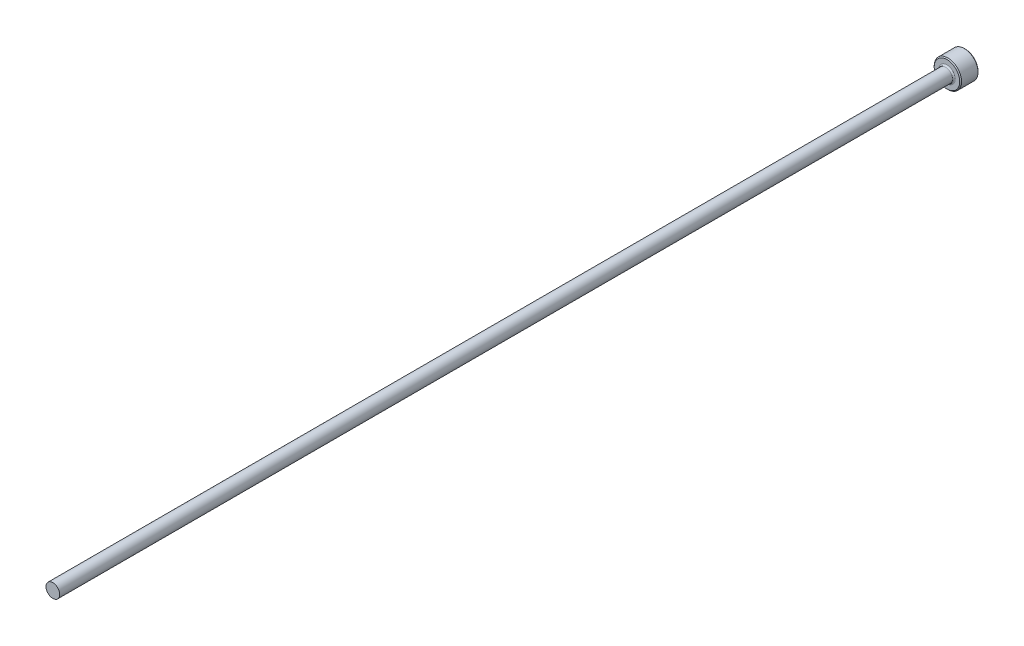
from build123d import *

# Parameters (mm, degrees)
CHAMFER1_SIZE = 0.2


with BuildPart() as part:
    # Sketch1 → Revolve1 (revolve)
    with BuildSketch(Plane(origin=(0, 0, 0), x_dir=(0, 0, -1), z_dir=(1, 0, 0)), mode=Mode.PRIVATE) as revolve1_sk:
        with BuildLine():
            Line((0, 0), (0, 3))
            Line((0, 3), (-4, 3))
            Line((-4, 3), (-4, 1.8))
            ThreePointArc((-4, 1.8), (-4.087867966, 1.587867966), (-4.3, 1.5))
            Line((-4.3, 1.5), (-200, 1.5))
            Line((-200, 1.5), (-200, 0))
            Line((-200, 0), (0, 0))
        make_face()
    revolve(revolve1_sk.sketch.rotate(Axis((0, 0, 109.05062828), (0, 0, -1)), 90), axis=Axis((0, 0, 109.05062828), (0, 0, -1)))

    # Chamfer1
    chamfer1_edges = [part.edges().sort_by_distance(p)[0] for p in [
        (-3, 0, 0),
        (-3, 0, 4),
    ]]
    chamfer(chamfer1_edges, length=CHAMFER1_SIZE)


solid = part.part
